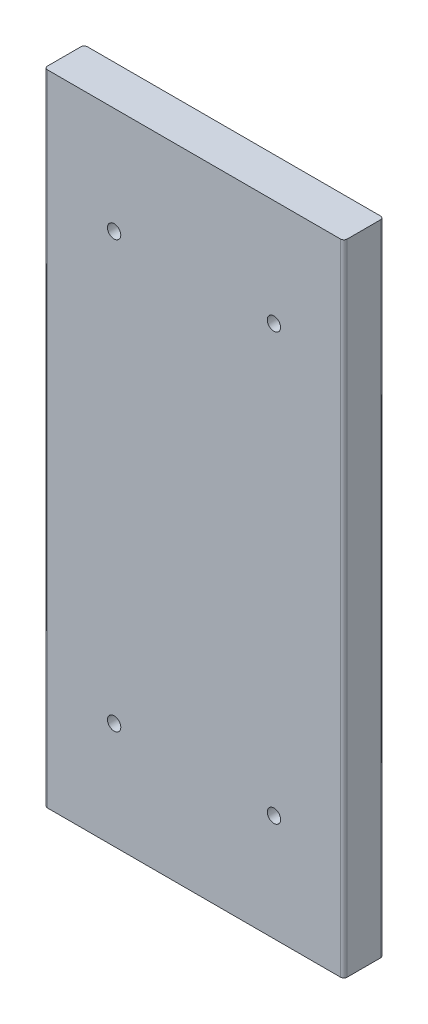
from build123d import *

# Parameters (mm, degrees)
SKETCH1_W           = 285.75
SKETCH1_H           = 609.6
SKETCH1_R           = 6.35
BOSS_EXTRUDE1_DEPTH = 38.1
FILLET1_R           = 3.175


with BuildPart() as part:
    # Sketch1 → Boss-Extrude1 (new body)
    with BuildSketch(Plane.XY):
        with Locations((142.875, 304.8)):
            Rectangle(SKETCH1_W, SKETCH1_H)
        with Locations(Location((66.675, 508, 0), (0, 0, 180))):
            Circle(SKETCH1_R, mode=Mode.SUBTRACT)
        with Locations(Location((66.675, 101.6, 0), (0, 0, 180))):
            Circle(SKETCH1_R, mode=Mode.SUBTRACT)
        with Locations(Location((219.075, 508, 0), (0, 0, 180))):
            Circle(SKETCH1_R, mode=Mode.SUBTRACT)
        with Locations(Location((219.075, 101.6, 0), (0, 0, 180))):
            Circle(SKETCH1_R, mode=Mode.SUBTRACT)
    extrude(amount=BOSS_EXTRUDE1_DEPTH)

    # Fillet1
    fillet1_edges = [part.edges().sort_by_distance(p)[0] for p in [
        (285.75, 304.8, 38.1),
        (0, 304.8, 38.1),
        (285.75, 304.8, 0),
        (0, 304.8, 0),
    ]]
    fillet(fillet1_edges, radius=FILLET1_R)


solid = part.part
